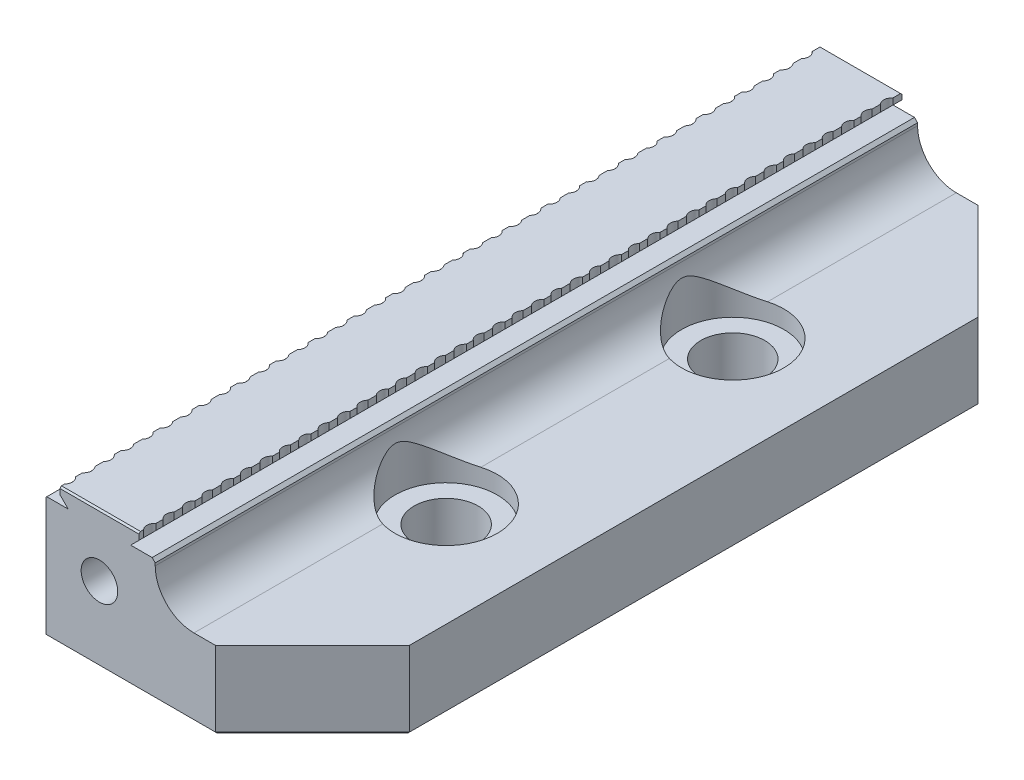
from build123d import *

# Parameters (mm, degrees)
BOSS_EXTRUDE1_DEPTH                = 62.4967
CUT_EXTRUDE1_JAW_TOOTH_REACH       = 71.976
LPATTERN1_COUNT                    = 20
LPATTERN1_PITCH                    = 6.35762
CBORE_FOR_M10_SHCS1_D              = 10.5
CBORE_FOR_M10_SHCS1_CBORE_D        = 16.764
CBORE_FOR_M10_SHCS1_CBORE_DEPTH    = 12.7
F_6_0MM_DOWEL_HOLE1_D              = 8.0127
F_6_0MM_DOWEL_HOLE1_DEPTH          = 6.858
CHAMFER1_SIZE                      = 15.875
CHAMFER2_SIZE                      = 0.254
OUTSIDE_DOVETAIL_CHAMFER_SIZE      = 0.508
INSIDE_DOVETAIL_CHAMFER_SIZE       = 0.508
BOTTOM_OUTSIDE_EDGE_CHAMFER_SIZE   = 0.381
OUTSIDE_JAW_FACE_EDGE_CHAMFER_SIZE = 0.381
FRONT_JAW_FACE_CHAMFERED_EDGE_SIZE = 0.381


with BuildPart() as part:
    # Sketch1 → Boss-Extrude1 (new, symmetric)
    with BuildSketch(Plane.XY):
        with BuildLine():
            Line((-22.0345, -11.2395), (22.0345, -11.2395))
            Line((22.0345, -11.2395), (22.0345, 1.4605))
            Line((22.0345, 1.4605), (2.6035, 1.4605))
            ThreePointArc((2.6035, 1.4605), (-1.886628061, 3.320371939), (-3.7465, 7.8105))
            Line((-3.7465, 7.8105), (-3.7465, 8.7395))
            Line((-3.7465, 8.7395), (-7.7705, 8.7395))
            Line((-7.7705, 8.7395), (-6.2865, 10.2235))
            Line((-6.2865, 10.2235), (-6.2865, 11.2395))
            Line((-6.2865, 11.2395), (-19.4945, 11.2395))
            Line((-19.4945, 11.2395), (-19.4945, 10.2235))
            Line((-19.4945, 10.2235), (-18.0105, 8.7395))
            Line((-18.0105, 8.7395), (-22.0345, 8.7395))
            Line((-22.0345, 8.7395), (-22.0345, -11.2395))
        make_face()
    extrude(amount=BOSS_EXTRUDE1_DEPTH, both=True)

    # Sketch8 → Cut-Extrude1 JAW TOOTH (cut, up to next)
    with BuildSketch(Plane(origin=(0, 11.2395, 0), x_dir=(1, 0, 0), z_dir=(0, 1, 0)), mode=Mode.PRIVATE) as cut_extrude1_jaw_tooth_sk1:
        with BuildLine():
            Line((-19.4945, 62.4967), (-19.4945, 60.9727))
            ThreePointArc((-19.4945, 60.9727), (-19.015440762, 60.045290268), (-19.3675, 59.06262))
            Line((-19.3675, 59.06262), (-19.3675, 57.67578))
            ThreePointArc((-19.3675, 57.67578), (-19.015440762, 56.693109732), (-19.4945, 55.7657))
            Line((-19.4945, 55.7657), (-22.233870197, 55.7657))
            Line((-22.233870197, 55.7657), (-22.233870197, 62.4967))
            Line((-22.233870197, 62.4967), (-19.4945, 62.4967))
        make_face()
    cut_extrude1_jaw_tooth_tool1 = extrude(cut_extrude1_jaw_tooth_sk1.sketch, amount=-CUT_EXTRUDE1_JAW_TOOTH_REACH, mode=Mode.PRIVATE) & part.part
    # Sketch8 → Cut-Extrude1 JAW TOOTH (cut, up to next)
    with BuildSketch(Plane(origin=(0, 11.2395, 0), x_dir=(1, 0, 0), z_dir=(0, 1, 0)), mode=Mode.PRIVATE) as cut_extrude1_jaw_tooth_sk2:
        with BuildLine():
            Line((-3.547129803, 62.4967), (-6.2865, 62.4967))
            Line((-6.2865, 62.4967), (-6.2865, 60.9727))
            ThreePointArc((-6.2865, 60.9727), (-6.765559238, 60.045290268), (-6.4135, 59.06262))
            Line((-6.4135, 59.06262), (-6.4135, 57.67578))
            ThreePointArc((-6.4135, 57.67578), (-6.765559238, 56.693109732), (-6.2865, 55.7657))
            Line((-6.2865, 55.7657), (-3.547129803, 55.7657))
            Line((-3.547129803, 55.7657), (-3.547129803, 62.4967))
        make_face()
    cut_extrude1_jaw_tooth_tool2 = extrude(cut_extrude1_jaw_tooth_sk2.sketch, amount=-CUT_EXTRUDE1_JAW_TOOTH_REACH, mode=Mode.PRIVATE) & part.part
    cut_extrude1_jaw_tooth_1 = cut_extrude1_jaw_tooth_tool1.solids().sort_by_distance((-20.745914, 11.2395, -59.073135))[0]
    add(cut_extrude1_jaw_tooth_1, mode=Mode.SUBTRACT)
    cut_extrude1_jaw_tooth_2 = cut_extrude1_jaw_tooth_tool2.solids().sort_by_distance((-5.035086, 11.2395, -59.073135))[0]
    add(cut_extrude1_jaw_tooth_2, mode=Mode.SUBTRACT)
    cut_extrude1_jaw_tooth = cut_extrude1_jaw_tooth_1 + cut_extrude1_jaw_tooth_2  # Cut-Extrude1 JAW TOOTH as one shape, for the pattern or mirror that repeats it

    # LPattern1: Cut-Extrude1 JAW TOOTH ×20
    with Locations(*[(0, 0, i * LPATTERN1_PITCH) for i in range(1, LPATTERN1_COUNT)]):
        add(cut_extrude1_jaw_tooth, mode=Mode.SUBTRACT)

    # CBORE for M10 SHCS1 (through all)
    with Locations(Plane(origin=(0, 11.2395, 0), x_dir=(-1, 0, 0), z_dir=(0, 1, 0))):
        with Locations((-4.953, -23.495), (-4.953, 23.495)):
            CounterBoreHole(CBORE_FOR_M10_SHCS1_D / 2, CBORE_FOR_M10_SHCS1_CBORE_D / 2, CBORE_FOR_M10_SHCS1_CBORE_DEPTH)

    # 6.0mm Dowel Hole1
    with Locations(Plane.XZ.offset(11.2395)):
        with Locations((16.653, 23.5), (-6.747, -23.5)):
            Hole(F_6_0MM_DOWEL_HOLE1_D / 2, depth=F_6_0MM_DOWEL_HOLE1_DEPTH)

    # Chamfer1
    chamfer1_edges = [part.edges().sort_by_distance(p)[0] for p in [
        (22.0345, -4.8895, 62.4967),
        (22.0345, -4.8895, -62.4967),
    ]]
    chamfer(chamfer1_edges, length=CHAMFER1_SIZE)

    # Chamfer2
    chamfer2_edges = [part.edges().sort_by_distance(p)[0] for p in [
        (-12.8905, 11.2395, -62.4967),
        (-12.8905, 11.2395, 62.4967),
    ]]
    chamfer(chamfer2_edges, length=CHAMFER2_SIZE)

    # Sketch13 → M6x1.0 Tapped Hole1 (revolve, cut)
    with BuildSketch(Plane(origin=(-12.8905, 1.0795, -62.4967), x_dir=(0, 1, 0), z_dir=(1, 0, 0))):
        Polygon((0, 0), (0, 16.488151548), (2.5, 14.986), (2.5, 11.9888), (3, 11.9888), (3, 0), align=None)
    m6x1_0_tapped_hole1 = revolve(axis=Axis((-12.8905, 1.0795, -68.8467), (0, 0, 1)), mode=Mode.SUBTRACT)

    # Mirror1: M6x1.0 Tapped Hole1 across plane
    add(m6x1_0_tapped_hole1.mirror(Plane.XY), mode=Mode.SUBTRACT)

    # OUTSIDE DOVETAIL CHAMFER
    outside_dovetail_chamfer_edges = [part.edges().sort_by_distance(p)[0] for p in [
        (-22.0345, 8.7395, 0),
    ]]
    chamfer(outside_dovetail_chamfer_edges, length=OUTSIDE_DOVETAIL_CHAMFER_SIZE)

    # INSIDE DOVETAIL CHAMFER
    inside_dovetail_chamfer_edges = [part.edges().sort_by_distance(p)[0] for p in [
        (-3.7465, 8.7395, 0),
    ]]
    chamfer(inside_dovetail_chamfer_edges, length=INSIDE_DOVETAIL_CHAMFER_SIZE)

    # BOTTOM OUTSIDE EDGE CHAMFER
    bottom_outside_edge_chamfer_edges = [part.edges().sort_by_distance(p)[0] for p in [
        (-7.9375, -11.2395, -62.4967),
        (-0.297, -11.2395, 23.495),
        (-0.297, -11.2395, -23.495),
        (22.0345, -11.2395, 0),
        (14.097, -11.2395, 54.5592),
        (14.097, -11.2395, -54.5592),
        (-7.9375, -11.2395, 62.4967),
    ]]
    chamfer(bottom_outside_edge_chamfer_edges, length=BOTTOM_OUTSIDE_EDGE_CHAMFER_SIZE)

    # OUTSIDE JAW FACE EDGE CHAMFER
    outside_jaw_face_edge_chamfer_edges = [part.edges().sort_by_distance(p)[0] for p in [
        (-22.0345, -1.3135, -62.4967),
        (-22.0345, -1.3135, 62.4967),
    ]]
    chamfer(outside_jaw_face_edge_chamfer_edges, length=OUTSIDE_JAW_FACE_EDGE_CHAMFER_SIZE)

    # FRONT JAW FACE CHAMFERED EDGE
    front_jaw_face_chamfered_edge_edges = [part.edges().sort_by_distance(p)[0] for p in [
        (-22.0345, -11.2395, 0),
    ]]
    chamfer(front_jaw_face_chamfered_edge_edges, length=FRONT_JAW_FACE_CHAMFERED_EDGE_SIZE)


solid = part.part
